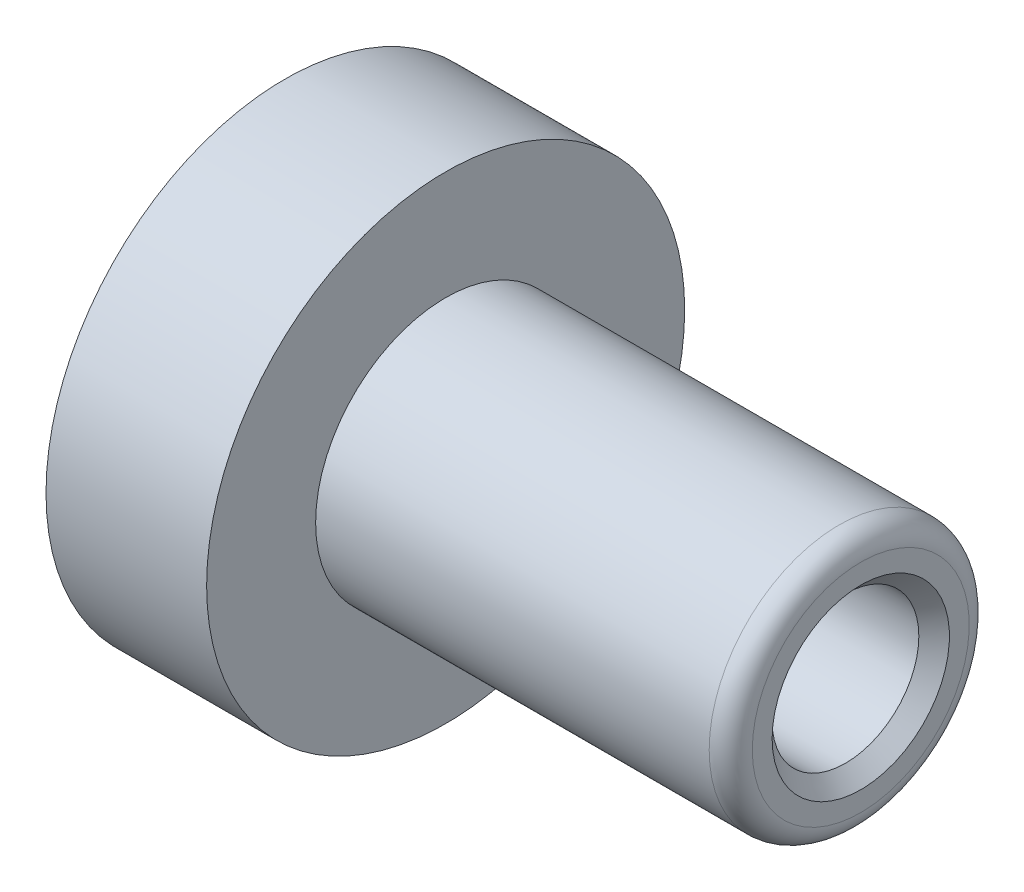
from build123d import *

# Parameters (mm, degrees)
SKETCH2_R          = 1.6129
CUT_EXTRUDE1_DEPTH = 6.35
SKETCH3_R          = 5.3594
CUT_EXTRUDE2_DEPTH = 18.5674
CHAMFER1_SIZE      = 1.1176


with BuildPart() as part:
    # Sketch1 → Revolve1 (revolve)
    with BuildSketch(Plane.XY, mode=Mode.PRIVATE) as revolve1_sk:
        with BuildLine():
            Line((0, 6.7437), (0, 17.4625))
            Line((0, 17.4625), (11.7348, 17.4625))
            Line((11.7348, 17.4625), (11.7348, 9.4996))
            Line((11.7348, 9.4996), (40.4876, 9.4996))
            ThreePointArc((40.4876, 9.4996), (41.601151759, 9.038351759), (42.0624, 7.9248))
            Line((42.0624, 7.9248), (42.0624, 0))
            Line((42.0624, 0), (20.4724, 0))
            Line((20.4724, 0), (20.4724, 6.7437))
            Line((20.4724, 6.7437), (0, 6.7437))
        make_face()
    revolve(revolve1_sk.sketch.rotate(Axis((0, 0, 0), (1, 0, 0)), 90), axis=Axis((0, 0, 0), (1, 0, 0)))

    # Sketch2 → Cut-Extrude1 (cut)
    with BuildSketch(Plane.ZY):
        with Locations((0, 11.1125)):
            Circle(SKETCH2_R)
        with Locations(Location((0, -11.1125, 0), (0, 0, 180))):
            Circle(SKETCH2_R)
    extrude(amount=-CUT_EXTRUDE1_DEPTH, mode=Mode.SUBTRACT)

    # Sketch3 → Cut-Extrude2 (cut)
    with BuildSketch(Plane(origin=(42.0624, 0, 0), x_dir=(0, 0, -1), z_dir=(1, 0, 0))):
        Circle(SKETCH3_R)
    extrude(amount=-CUT_EXTRUDE2_DEPTH, mode=Mode.SUBTRACT)

    # Chamfer1
    chamfer1_edges = [part.edges().sort_by_distance(p)[0] for p in [
        (42.0624, 0, 5.3594),
    ]]
    chamfer(chamfer1_edges, length=CHAMFER1_SIZE)


solid = part.part
